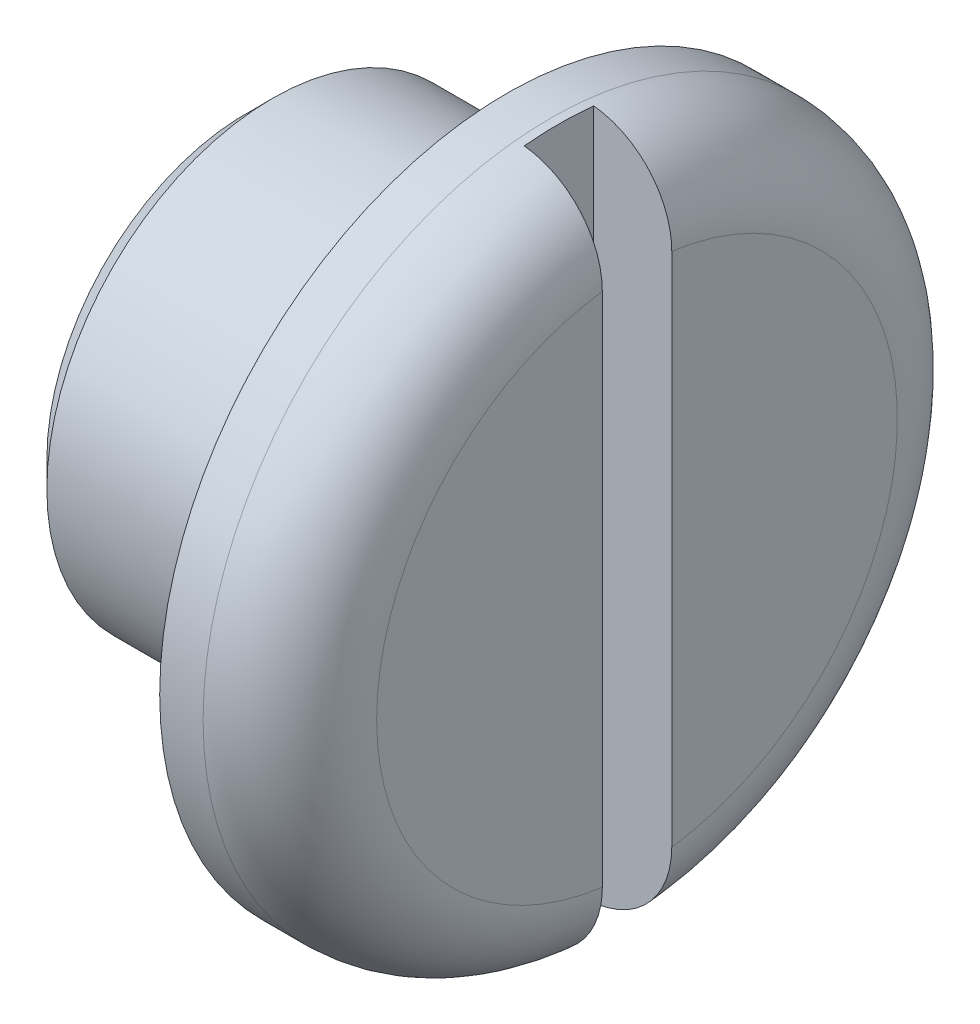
from build123d import *

# Parameters (mm, degrees)
SKIZZE3_W                       = 0.4
SKIZZE3_H                       = 5.813868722
SCHNITT_LINEAR_AUSTRAGEN1_DEPTH = 0.45
FASE1_SIZE                      = 0.15


with BuildPart() as part:
    # Skizze2 → Rotation1 (revolve)
    with BuildSketch(Plane.XY, mode=Mode.PRIVATE) as rotation1_sk:
        with BuildLine():
            Line((0, 0), (2.25, 0))
            Line((2.25, 0), (2.25, 1.5))
            ThreePointArc((2.25, 1.5), (2.103553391, 1.853553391), (1.75, 2))
            Line((1.75, 2), (1.5, 2))
            Line((1.5, 2), (1.5, 1.3))
            Line((1.5, 1.3), (0, 1.3))
            Line((0, 1.3), (0, 0))
        make_face()
    revolve(rotation1_sk.sketch.rotate(Axis((0, 0, 0), (1, 0, 0)), 90), axis=Axis((0, 0, 0), (1, 0, 0)))

    # Skizze3 → Schnitt-Linear austragen1 (cut)
    with BuildSketch(Plane(origin=(2.25, 0, 0), x_dir=(0, 0, -1), z_dir=(1, 0, 0))):
        with Locations((0, -0.356840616)):
            Rectangle(SKIZZE3_W, SKIZZE3_H)
    extrude(amount=-SCHNITT_LINEAR_AUSTRAGEN1_DEPTH, mode=Mode.SUBTRACT)

    # Fase1
    fase1_edges = [part.edges().sort_by_distance(p)[0] for p in [
        (0, 0, -1.3),
    ]]
    chamfer(fase1_edges, length=FASE1_SIZE)


solid = part.part
